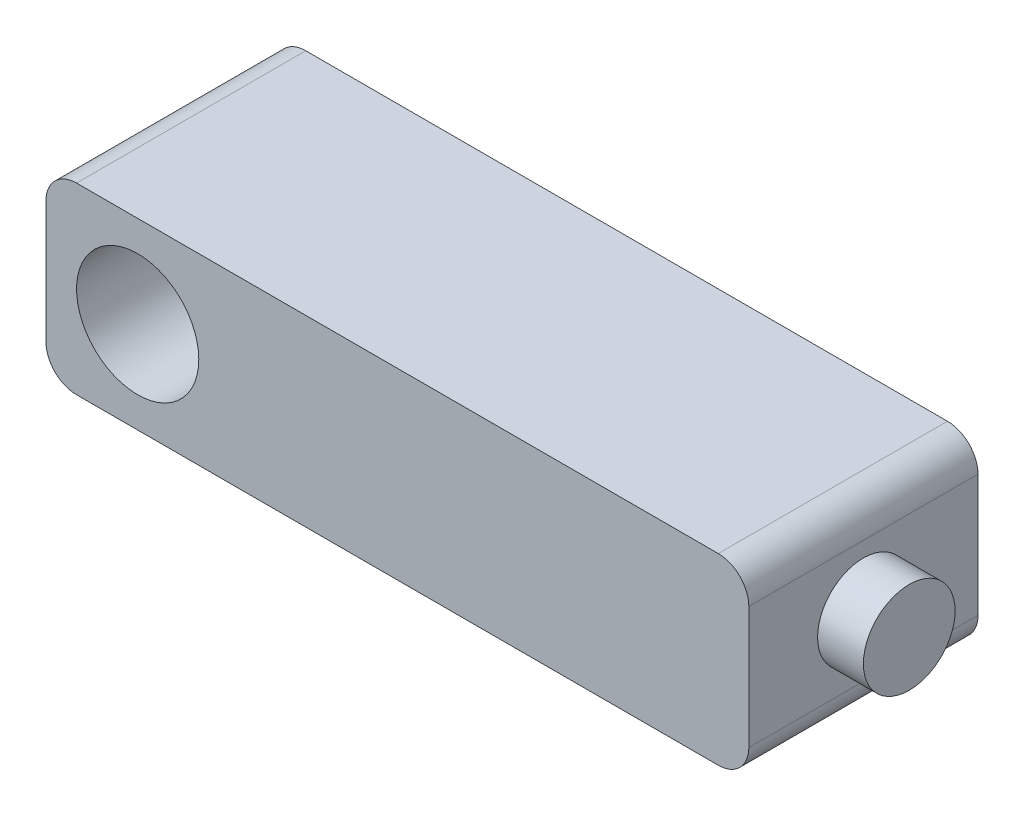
from build123d import *

# Parameters (mm, degrees)
SKETCH_1_W          = 460
SKETCH_1_H          = 120
EXTRUDE_1_DEPTH     = 150
SKETCH_2_R          = 40
CUT_EXTRUDE_2_DEPTH = 499.497743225
SKETCH_3_R          = 30
EXTRUDE_3_DEPTH     = 30
FILLET_1_R          = 20


with BuildPart() as part:
    # Sketch 1 → Extrude 1 (new body)
    with BuildSketch(Plane.XY):
        with Locations((230, 60)):
            Rectangle(SKETCH_1_W, SKETCH_1_H)
    extrude(amount=EXTRUDE_1_DEPTH)

    # Sketch 2 → Cut-Extrude 2 (cut, through all)
    with BuildSketch(Plane.XY.offset(150)):
        with Locations((60, 60)):
            Circle(SKETCH_2_R)
    extrude(amount=-CUT_EXTRUDE_2_DEPTH, mode=Mode.SUBTRACT)

    # Sketch 3 → Extrude 3 (add)
    with BuildSketch(Plane(origin=(460, 0, 0), x_dir=(0, 0, -1), z_dir=(1, 0, 0))):
        with Locations(Location((-75, 60, 0), (0, 0, 180))):
            Circle(SKETCH_3_R)
    extrude(amount=EXTRUDE_3_DEPTH)

    # Fillet 1
    fillet_1_edges = [part.edges().sort_by_distance(p)[0] for p in [
        (0, 120, 75),
        (460, 120, 75),
        (460, 0, 75),
        (0, 0, 75),
    ]]
    fillet(fillet_1_edges, radius=FILLET_1_R)


solid = part.part
